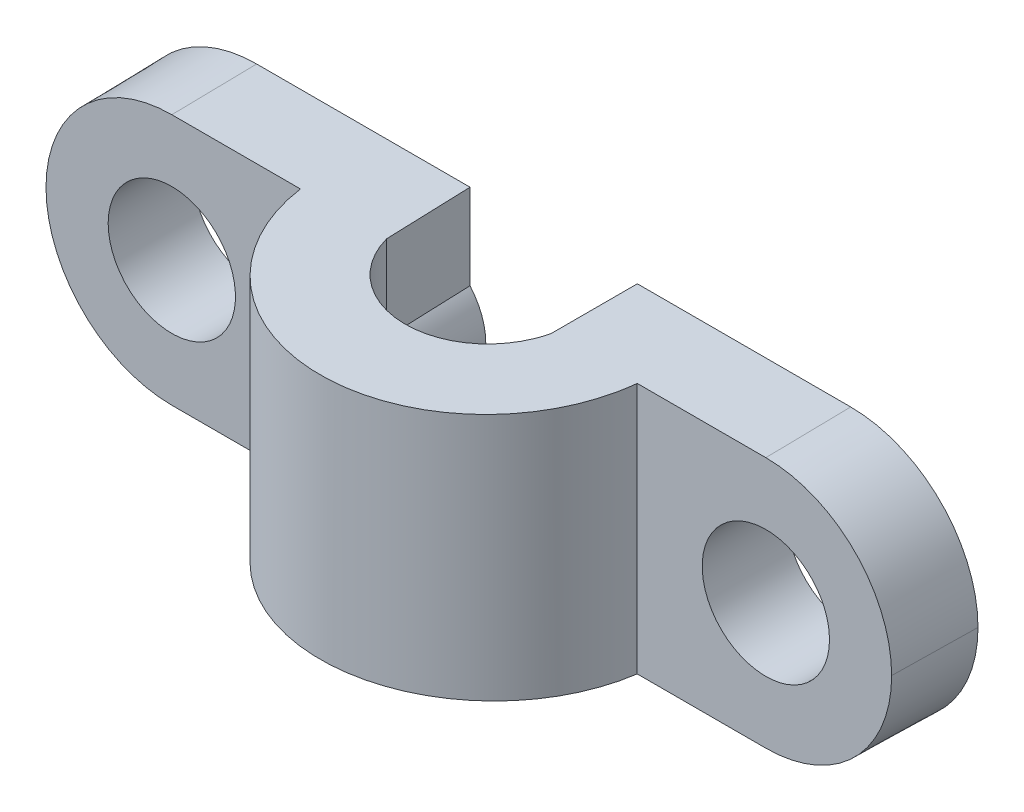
ISO-10303-21;
HEADER;
FILE_DESCRIPTION(('STEP AP214'),'2;1');
FILE_NAME('part.step','',(''),(''),'','','');
FILE_SCHEMA(('AUTOMOTIVE_DESIGN { 1 0 10303 214 1 1 1 1 }'));
ENDSEC;
DATA;
#1=APPLICATION_CONTEXT('core data for automotive mechanical design processes');
#2=APPLICATION_PROTOCOL_DEFINITION('international standard','automotive_design',2000,#1);
#3=PRODUCT_CONTEXT('',#1,'mechanical');
#4=PRODUCT('Part','Part','',(#3));
#5=PRODUCT_RELATED_PRODUCT_CATEGORY('part','',(#4));
#6=PRODUCT_DEFINITION_FORMATION('','',#4);
#7=PRODUCT_DEFINITION_CONTEXT('part definition',#1,'design');
#8=PRODUCT_DEFINITION('design','',#6,#7);
#9=PRODUCT_DEFINITION_SHAPE('','',#8);
#10=(LENGTH_UNIT() NAMED_UNIT(*) SI_UNIT(.MILLI.,.METRE.));
#11=(NAMED_UNIT(*) PLANE_ANGLE_UNIT() SI_UNIT($,.RADIAN.));
#12=(NAMED_UNIT(*) SI_UNIT($,.STERADIAN.) SOLID_ANGLE_UNIT());
#13=UNCERTAINTY_MEASURE_WITH_UNIT(LENGTH_MEASURE(1.E-05),#10,'distance_accuracy_value','');
#14=(GEOMETRIC_REPRESENTATION_CONTEXT(3) GLOBAL_UNCERTAINTY_ASSIGNED_CONTEXT((#13)) GLOBAL_UNIT_ASSIGNED_CONTEXT((#10,
#11,#12)) REPRESENTATION_CONTEXT('',''));
#15=CARTESIAN_POINT('',(0.,0.,0.));
#16=DIRECTION('',(0.,0.,1.));
#17=DIRECTION('',(1.,0.,0.));
#18=AXIS2_PLACEMENT_3D('',#15,#16,#17);
#19=CARTESIAN_POINT('',(-15.973571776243,-147.245065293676,1.99995));
#20=DIRECTION('',(-0.999847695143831,-5.01170538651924E-06,-0.0174524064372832));
#21=DIRECTION('',(-0.0174524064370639,-8.74796429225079E-08,0.999847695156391));
#22=AXIS2_PLACEMENT_3D('',#19,#20,#21);
#23=PLANE('',#22);
#24=DIRECTION('',(-5.01246880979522E-06,0.999999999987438,0.));
#25=VECTOR('',#24,1.);
#26=CARTESIAN_POINT('',(-15.9386625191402,-147.245065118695,0.));
#27=LINE('',#26,#25);
#28=CARTESIAN_POINT('',(-15.9386625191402,-147.245065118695,0.));
#29=VERTEX_POINT('',#28);
#30=CARTESIAN_POINT('',(-15.9386524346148,-149.256953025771,0.));
#31=VERTEX_POINT('',#30);
#32=EDGE_CURVE('E164',#29,#31,#27,.F.);
#33=ORIENTED_EDGE('',*,*,#32,.T.);
#34=CARTESIAN_POINT('',(-14.810077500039,-150.244984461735,-64.6557309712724));
#35=DIRECTION('',(-0.999847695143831,-5.01170538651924E-06,-0.0174524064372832));
#36=DIRECTION('',(-0.0174524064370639,-8.74796429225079E-08,0.999847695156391));
#37=AXIS2_PLACEMENT_3D('',#34,#35,#36);
#38=ELLIPSE('',#37,85.9458840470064,1.4999625);
#39=CARTESIAN_POINT('',(-15.9648342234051,-149.287683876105,1.4999625));
#40=VERTEX_POINT('',#39);
#41=EDGE_CURVE('E20',#31,#40,#38,.F.);
#42=ORIENTED_EDGE('',*,*,#41,.T.);
#43=CARTESIAN_POINT('',(-15.9735618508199,-149.22521188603,1.99994999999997));
#44=CARTESIAN_POINT('',(-15.9726841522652,-149.23789250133,1.9496703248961));
#45=CARTESIAN_POINT('',(-15.9717988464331,-149.24911449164,1.89895441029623));
#46=CARTESIAN_POINT('',(-15.9700230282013,-149.267666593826,1.797223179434));
#47=CARTESIAN_POINT('',(-15.9691326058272,-149.275025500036,1.74621302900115));
#48=CARTESIAN_POINT('',(-15.9673422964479,-149.285100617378,1.64364916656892));
#49=CARTESIAN_POINT('',(-15.9664424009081,-149.287812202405,1.59209496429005));
#50=CARTESIAN_POINT('',(-15.9650892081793,-149.288136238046,1.51457069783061));
#51=CARTESIAN_POINT('',(-15.9646358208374,-149.287610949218,1.4885960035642));
#52=CARTESIAN_POINT('',(-15.9637299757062,-149.285324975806,1.43669951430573));
#53=CARTESIAN_POINT('',(-15.9632775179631,-149.28356423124,1.4107777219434));
#54=CARTESIAN_POINT('',(-15.9628259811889,-149.281201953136,1.38490851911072));
#55=B_SPLINE_CURVE_WITH_KNOTS('',3,(#43,#44,#45,#46,#47,#48,#49,#50,#51,#52,#53,#54),
.UNSPECIFIED.,.F.,.F.,(4,2,2,2,2,4),(0.,0.15566218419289,0.310147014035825,0.464785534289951,
0.542711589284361,0.620641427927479),.UNSPECIFIED.);
#56=CARTESIAN_POINT('',(-15.9735618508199,-149.22521188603,1.99995));
#57=VERTEX_POINT('',#56);
#58=EDGE_CURVE('E205',#40,#57,#55,.F.);
#59=ORIENTED_EDGE('',*,*,#58,.T.);
#60=DIRECTION('',(5.01246880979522E-06,-0.999999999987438,0.));
#61=VECTOR('',#60,1.);
#62=CARTESIAN_POINT('',(-15.973571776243,-147.245065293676,1.99995));
#63=LINE('',#62,#61);
#64=CARTESIAN_POINT('',(-15.9735716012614,-147.279974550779,1.99995));
#65=VERTEX_POINT('',#64);
#66=EDGE_CURVE('E200',#65,#57,#63,.T.);
#67=ORIENTED_EDGE('',*,*,#66,.F.);
#68=DIRECTION('',(0.0174496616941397,0.0174498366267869,-0.999695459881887));
#69=VECTOR('',#68,1.);
#70=CARTESIAN_POINT('',(-15.9735609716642,-147.279963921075,1.99934102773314));
#71=LINE('',#70,#69);
#72=EDGE_CURVE('E174',#29,#65,#71,.F.);
#73=ORIENTED_EDGE('',*,*,#72,.F.);
#74=EDGE_LOOP('',(#33,#42,#59,#67,#73));
#75=FACE_BOUND('',#74,.T.);
#76=ADVANCED_FACE('F16',(#75),#23,.T.);
#77=CARTESIAN_POINT('',(-19.846458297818,-147.245084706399,1.99995));
#78=DIRECTION('',(0.999847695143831,5.01170538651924E-06,-0.017452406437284));
#79=DIRECTION('',(-0.0174524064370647,-8.74796429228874E-08,-0.999847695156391));
#80=AXIS2_PLACEMENT_3D('',#77,#78,#79);
#81=PLANE('',#80);
#82=DIRECTION('',(-5.01246880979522E-06,0.999999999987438,0.));
#83=VECTOR('',#82,1.);
#84=CARTESIAN_POINT('',(-19.8813675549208,-147.245084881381,0.));
#85=LINE('',#84,#83);
#86=CARTESIAN_POINT('',(-19.8813475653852,-151.233046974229,0.));
#87=VERTEX_POINT('',#86);
#88=CARTESIAN_POINT('',(-19.8813374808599,-153.244934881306,0.));
#89=VERTEX_POINT('',#88);
#90=EDGE_CURVE('E801',#87,#89,#85,.F.);
#91=ORIENTED_EDGE('',*,*,#90,.F.);
#92=CARTESIAN_POINT('',(-21.0099224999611,-150.245015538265,-64.6557309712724));
#93=DIRECTION('',(0.999847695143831,5.01170538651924E-06,-0.017452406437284));
#94=DIRECTION('',(0.0174524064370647,8.74796429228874E-08,0.999847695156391));
#95=AXIS2_PLACEMENT_3D('',#92,#93,#94);
#96=ELLIPSE('',#95,85.9458840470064,1.4999625);
#97=CARTESIAN_POINT('',(-19.8551657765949,-151.202316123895,1.4999625));
#98=VERTEX_POINT('',#97);
#99=EDGE_CURVE('E249',#87,#98,#96,.F.);
#100=ORIENTED_EDGE('',*,*,#99,.T.);
#101=CARTESIAN_POINT('',(-19.8464381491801,-151.264788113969,1.99995));
#102=CARTESIAN_POINT('',(-19.8473158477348,-151.25210749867,1.9496703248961));
#103=CARTESIAN_POINT('',(-19.8482011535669,-151.24088550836,1.89895441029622));
#104=CARTESIAN_POINT('',(-19.8499769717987,-151.222333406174,1.79722317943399));
#105=CARTESIAN_POINT('',(-19.8508673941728,-151.214974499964,1.74621302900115));
#106=CARTESIAN_POINT('',(-19.8526577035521,-151.204899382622,1.64364916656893));
#107=CARTESIAN_POINT('',(-19.8535575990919,-151.202187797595,1.59209496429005));
#108=CARTESIAN_POINT('',(-19.8549107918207,-151.201863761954,1.5145706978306));
#109=CARTESIAN_POINT('',(-19.8553641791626,-151.202389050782,1.48859600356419));
#110=CARTESIAN_POINT('',(-19.8562700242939,-151.204675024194,1.43669951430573));
#111=CARTESIAN_POINT('',(-19.8567224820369,-151.20643576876,1.4107777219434));
#112=CARTESIAN_POINT('',(-19.8571740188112,-151.208798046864,1.38490851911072));
#113=B_SPLINE_CURVE_WITH_KNOTS('',3,(#101,#102,#103,#104,#105,#106,#107,#108,#109,#110,#111,
#112),.UNSPECIFIED.,.F.,.F.,(4,2,2,2,2,4),(0.,0.155662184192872,0.310147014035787,
0.46478553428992,0.542711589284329,0.620641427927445),.UNSPECIFIED.);
#114=CARTESIAN_POINT('',(-19.8464381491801,-151.264788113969,1.99995));
#115=VERTEX_POINT('',#114);
#116=EDGE_CURVE('E203',#98,#115,#113,.F.);
#117=ORIENTED_EDGE('',*,*,#116,.T.);
#118=DIRECTION('',(5.01246880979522E-06,-0.999999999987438,0.));
#119=VECTOR('',#118,1.);
#120=CARTESIAN_POINT('',(-19.846458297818,-147.245084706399,1.99995));
#121=LINE('',#120,#119);
#122=CARTESIAN_POINT('',(-19.8464283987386,-153.210025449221,1.99995));
#123=VERTEX_POINT('',#122);
#124=EDGE_CURVE('E247',#115,#123,#121,.T.);
#125=ORIENTED_EDGE('',*,*,#124,.T.);
#126=DIRECTION('',(-0.0174496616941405,-0.0174498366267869,-0.999695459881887));
#127=VECTOR('',#126,1.);
#128=CARTESIAN_POINT('',(-19.8446121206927,-153.208209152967,2.10400502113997));
#129=LINE('',#128,#127);
#130=EDGE_CURVE('E991',#123,#89,#129,.T.);
#131=ORIENTED_EDGE('',*,*,#130,.T.);
#132=EDGE_LOOP('',(#91,#100,#117,#125,#131));
#133=FACE_BOUND('',#132,.T.);
#134=ADVANCED_FACE('F250',(#133),#81,.T.);
#135=CARTESIAN_POINT('',(-17.9100150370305,-147.245075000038,1.4999625));
#136=DIRECTION('',(5.01246880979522E-06,-0.999999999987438,0.));
#137=DIRECTION('',(0.999999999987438,5.01246880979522E-06,0.));
#138=AXIS2_PLACEMENT_3D('',#135,#136,#137);
#139=CYLINDRICAL_SURFACE('',#138,1.99995);
#140=ORIENTED_EDGE('',*,*,#124,.F.);
#141=CARTESIAN_POINT('',(-17.9099948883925,-151.264778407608,1.4999625));
#142=DIRECTION('',(-5.01246880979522E-06,0.999999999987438,0.));
#143=DIRECTION('',(-0.999999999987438,-5.01246880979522E-06,0.));
#144=AXIS2_PLACEMENT_3D('',#141,#142,#143);
#145=CIRCLE('',#144,1.99995);
#146=CARTESIAN_POINT('',(-15.973551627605,-151.264768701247,1.99995));
#147=VERTEX_POINT('',#146);
#148=EDGE_CURVE('E675',#115,#147,#145,.T.);
#149=ORIENTED_EDGE('',*,*,#148,.T.);
#150=DIRECTION('',(5.01246880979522E-06,-0.999999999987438,0.));
#151=VECTOR('',#150,1.);
#152=CARTESIAN_POINT('',(-15.973571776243,-147.245065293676,1.99995));
#153=LINE('',#152,#151);
#154=CARTESIAN_POINT('',(-15.9735418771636,-153.210006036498,1.99995));
#155=VERTEX_POINT('',#154);
#156=EDGE_CURVE('E204',#147,#155,#153,.T.);
#157=ORIENTED_EDGE('',*,*,#156,.T.);
#158=CARTESIAN_POINT('',(-17.9099850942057,-153.218743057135,1.4999625));
#159=DIRECTION('',(5.01170538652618E-06,-0.999847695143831,0.0174524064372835));
#160=DIRECTION('',(8.74796424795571E-08,-0.0174524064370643,-0.999847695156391));
#161=AXIS2_PLACEMENT_3D('',#158,#159,#160);
#162=ELLIPSE('',#161,2.00025464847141,1.99995);
#163=EDGE_CURVE('E1005',#155,#123,#162,.T.);
#164=ORIENTED_EDGE('',*,*,#163,.T.);
#165=EDGE_LOOP('',(#140,#149,#157,#164));
#166=FACE_BOUND('',#165,.T.);
#167=ADVANCED_FACE('F219',(#166),#139,.F.);
#168=ORIENTED_EDGE('',*,*,#66,.T.);
#169=CARTESIAN_POINT('',(-17.9100051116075,-149.225221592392,1.4999625));
#170=DIRECTION('',(5.01246880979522E-06,-0.999999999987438,0.));
#171=DIRECTION('',(0.999999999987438,5.01246880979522E-06,0.));
#172=AXIS2_PLACEMENT_3D('',#169,#170,#171);
#173=CIRCLE('',#172,1.99995);
#174=CARTESIAN_POINT('',(-19.846448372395,-149.225231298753,1.99995));
#175=VERTEX_POINT('',#174);
#176=EDGE_CURVE('E663',#57,#175,#173,.T.);
#177=ORIENTED_EDGE('',*,*,#176,.T.);
#178=DIRECTION('',(5.01246880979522E-06,-0.999999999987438,0.));
#179=VECTOR('',#178,1.);
#180=CARTESIAN_POINT('',(-19.846458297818,-147.245084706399,1.99995));
#181=LINE('',#180,#179);
#182=CARTESIAN_POINT('',(-19.8464581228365,-147.279993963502,1.99995));
#183=VERTEX_POINT('',#182);
#184=EDGE_CURVE('E770',#183,#175,#181,.T.);
#185=ORIENTED_EDGE('',*,*,#184,.F.);
#186=CARTESIAN_POINT('',(-17.9100149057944,-147.271256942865,1.4999625));
#187=DIRECTION('',(-5.0117053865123E-06,0.999847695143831,0.0174524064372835));
#188=DIRECTION('',(8.74796433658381E-08,-0.0174524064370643,0.999847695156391));
#189=AXIS2_PLACEMENT_3D('',#186,#187,#188);
#190=ELLIPSE('',#189,2.00025464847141,1.99995);
#191=EDGE_CURVE('E198',#65,#183,#190,.F.);
#192=ORIENTED_EDGE('',*,*,#191,.F.);
#193=EDGE_LOOP('',(#168,#177,#185,#192));
#194=FACE_BOUND('',#193,.T.);
#195=ADVANCED_FACE('F270',(#194),#139,.F.);
#196=CARTESIAN_POINT('',(-15.973571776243,-147.245065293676,1.99995));
#197=DIRECTION('',(-0.999847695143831,-5.01170538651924E-06,-0.0174524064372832));
#198=DIRECTION('',(-0.0174524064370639,-8.74796429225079E-08,0.999847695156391));
#199=AXIS2_PLACEMENT_3D('',#196,#197,#198);
#200=PLANE('',#199);
#201=CARTESIAN_POINT('',(-15.9863360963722,-151.504021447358,2.73244042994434));
#202=CARTESIAN_POINT('',(-15.9855881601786,-151.4894685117,2.68958701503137));
#203=CARTESIAN_POINT('',(-15.9848419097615,-151.47464032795,2.64683009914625));
#204=CARTESIAN_POINT('',(-15.9833505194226,-151.444784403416,2.5613798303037));
#205=CARTESIAN_POINT('',(-15.982605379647,-151.42975663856,2.51868648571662));
#206=CARTESIAN_POINT('',(-15.9811050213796,-151.399673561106,2.43272237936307));
#207=CARTESIAN_POINT('',(-15.9803497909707,-151.384620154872,2.38945093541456));
#208=CARTESIAN_POINT('',(-15.9788357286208,-151.355127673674,2.3027018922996));
#209=CARTESIAN_POINT('',(-15.9780768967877,-151.340688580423,2.2592242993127));
#210=CARTESIAN_POINT('',(-15.975865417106,-151.300411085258,2.13251714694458));
#211=CARTESIAN_POINT('',(-15.9744042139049,-151.276035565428,2.04879787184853));
#212=CARTESIAN_POINT('',(-15.9714517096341,-151.236049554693,1.87963753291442));
#213=CARTESIAN_POINT('',(-15.969960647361,-151.220386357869,1.79421013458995));
#214=CARTESIAN_POINT('',(-15.9673564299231,-151.20457685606,1.64501007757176));
#215=CARTESIAN_POINT('',(-15.9662491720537,-151.201395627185,1.58157440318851));
#216=CARTESIAN_POINT('',(-15.96403248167,-151.202638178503,1.45458065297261));
#217=CARTESIAN_POINT('',(-15.9629230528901,-151.207085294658,1.39102279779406));
#218=CARTESIAN_POINT('',(-15.9606857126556,-151.223004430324,1.26285023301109));
#219=CARTESIAN_POINT('',(-15.9595583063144,-151.234691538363,1.19826452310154));
#220=CARTESIAN_POINT('',(-15.9573279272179,-151.263220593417,1.07049438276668));
#221=CARTESIAN_POINT('',(-15.9562248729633,-151.280041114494,1.00730527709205));
#222=CARTESIAN_POINT('',(-15.9551330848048,-151.298461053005,0.944762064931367));
#223=B_SPLINE_CURVE_WITH_KNOTS('',3,(#201,#202,#203,#204,#205,#206,#207,#208,#209,#210,#211,
#212,#213,#214,#215,#216,#217,#218,#219,#220,#221,#222),.UNSPECIFIED.,.F.,.F.,(4,2,2,2,2,2,2,2,
2,2,4),(0.,0.135784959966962,0.271586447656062,0.409047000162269,0.546503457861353,
0.807920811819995,1.06773900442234,1.25787517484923,1.44859403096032,1.64527011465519,
1.84113628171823),.UNSPECIFIED.);
#224=CARTESIAN_POINT('',(-15.9648246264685,-151.202296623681,1.4999625));
#225=VERTEX_POINT('',#224);
#226=EDGE_CURVE('E210',#147,#225,#223,.T.);
#227=ORIENTED_EDGE('',*,*,#226,.T.);
#228=CARTESIAN_POINT('',(-14.810077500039,-150.244984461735,-64.6557309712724));
#229=DIRECTION('',(-0.999847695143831,-5.01170538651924E-06,-0.0174524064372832));
#230=DIRECTION('',(-0.0174524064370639,-8.74796429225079E-08,0.999847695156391));
#231=AXIS2_PLACEMENT_3D('',#228,#229,#230);
#232=ELLIPSE('',#231,85.9458840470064,1.4999625);
#233=CARTESIAN_POINT('',(-15.9386425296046,-151.233027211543,0.));
#234=VERTEX_POINT('',#233);
#235=EDGE_CURVE('E150',#225,#234,#232,.F.);
#236=ORIENTED_EDGE('',*,*,#235,.T.);
#237=DIRECTION('',(-5.01246880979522E-06,0.999999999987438,0.));
#238=VECTOR('',#237,1.);
#239=CARTESIAN_POINT('',(-15.9386625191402,-147.245065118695,0.));
#240=LINE('',#239,#238);
#241=CARTESIAN_POINT('',(-15.9386324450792,-153.244915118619,0.));
#242=VERTEX_POINT('',#241);
#243=EDGE_CURVE('E168',#234,#242,#240,.F.);
#244=ORIENTED_EDGE('',*,*,#243,.T.);
#245=DIRECTION('',(-0.0174498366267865,0.0174496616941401,0.999695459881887));
#246=VECTOR('',#245,1.);
#247=CARTESIAN_POINT('',(-15.9753581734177,-153.208189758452,2.10400502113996));
#248=LINE('',#247,#246);
#249=EDGE_CURVE('E1016',#242,#155,#248,.T.);
#250=ORIENTED_EDGE('',*,*,#249,.T.);
#251=ORIENTED_EDGE('',*,*,#156,.F.);
#252=EDGE_LOOP('',(#227,#236,#244,#250,#251));
#253=FACE_BOUND('',#252,.T.);
#254=ADVANCED_FACE('F254',(#253),#200,.T.);
#255=CARTESIAN_POINT('',(-19.846458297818,-147.245084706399,1.99995));
#256=DIRECTION('',(0.999847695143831,5.01170538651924E-06,-0.017452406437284));
#257=DIRECTION('',(-0.0174524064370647,-8.74796429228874E-08,-0.999847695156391));
#258=AXIS2_PLACEMENT_3D('',#255,#256,#257);
#259=PLANE('',#258);
#260=CARTESIAN_POINT('',(-19.8318989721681,-148.952226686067,2.83356297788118));
#261=CARTESIAN_POINT('',(-19.8326917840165,-148.967070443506,2.78813855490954));
#262=CARTESIAN_POINT('',(-19.8334820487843,-148.982342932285,2.74285993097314));
#263=CARTESIAN_POINT('',(-19.8350596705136,-149.013370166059,2.65246913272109));
#264=CARTESIAN_POINT('',(-19.8358470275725,-149.029124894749,2.60735695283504));
#265=CARTESIAN_POINT('',(-19.8374295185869,-149.060912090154,2.51668697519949));
#266=CARTESIAN_POINT('',(-19.8382246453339,-149.076945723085,2.47112959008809));
#267=CARTESIAN_POINT('',(-19.8398171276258,-149.108643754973,2.37988723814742));
#268=CARTESIAN_POINT('',(-19.840614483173,-149.124308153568,2.3342022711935));
#269=CARTESIAN_POINT('',(-19.8429439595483,-149.168607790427,2.20073393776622));
#270=CARTESIAN_POINT('',(-19.8444832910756,-149.196050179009,2.11253781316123));
#271=CARTESIAN_POINT('',(-19.8475956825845,-149.242418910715,1.93421570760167));
#272=CARTESIAN_POINT('',(-19.8491685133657,-149.261390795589,1.84410284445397));
#273=CARTESIAN_POINT('',(-19.8516789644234,-149.280349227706,1.70027375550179));
#274=CARTESIAN_POINT('',(-19.8526055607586,-149.284964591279,1.64718776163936));
#275=CARTESIAN_POINT('',(-19.8544637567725,-149.288920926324,1.54073064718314));
#276=CARTESIAN_POINT('',(-19.8553953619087,-149.28825388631,1.48735921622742));
#277=CARTESIAN_POINT('',(-19.8572723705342,-149.281642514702,1.37982736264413));
#278=CARTESIAN_POINT('',(-19.8582176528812,-149.275587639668,1.32567391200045));
#279=CARTESIAN_POINT('',(-19.8596253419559,-149.263064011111,1.24503105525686));
#280=CARTESIAN_POINT('',(-19.8600927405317,-149.258317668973,1.21825517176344));
#281=CARTESIAN_POINT('',(-19.8610238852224,-149.247825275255,1.16491294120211));
#282=CARTESIAN_POINT('',(-19.861487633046,-149.24207972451,1.13834649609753));
#283=CARTESIAN_POINT('',(-19.8619496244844,-149.235905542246,1.11188079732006));
#284=B_SPLINE_CURVE_WITH_KNOTS('',3,(#260,#261,#262,#263,#264,#265,#266,#267,#268,#269,#270,
#271,#272,#273,#274,#275,#276,#277,#278,#279,#280,#281,#282,#283),.UNSPECIFIED.,.F.,.F.,(4,2,2,
2,2,2,2,2,2,2,2,4),(0.,0.143374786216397,0.286744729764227,0.431653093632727,0.576561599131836,
0.853566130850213,1.12906286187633,1.28870455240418,1.44858840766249,1.61183026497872,
1.69340695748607,1.77494287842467),.UNSPECIFIED.);
#285=CARTESIAN_POINT('',(-19.8551753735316,-149.287703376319,1.4999625));
#286=VERTEX_POINT('',#285);
#287=EDGE_CURVE('E226',#175,#286,#284,.T.);
#288=ORIENTED_EDGE('',*,*,#287,.T.);
#289=CARTESIAN_POINT('',(-21.0099224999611,-150.245015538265,-64.6557309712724));
#290=DIRECTION('',(0.999847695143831,5.01170538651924E-06,-0.017452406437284));
#291=DIRECTION('',(0.0174524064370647,8.74796429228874E-08,0.999847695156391));
#292=AXIS2_PLACEMENT_3D('',#289,#290,#291);
#293=ELLIPSE('',#292,85.9458840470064,1.4999625);
#294=CARTESIAN_POINT('',(-19.8813574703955,-149.256972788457,0.));
#295=VERTEX_POINT('',#294);
#296=EDGE_CURVE('E194',#286,#295,#293,.F.);
#297=ORIENTED_EDGE('',*,*,#296,.T.);
#298=DIRECTION('',(-5.01246880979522E-06,0.999999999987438,0.));
#299=VECTOR('',#298,1.);
#300=CARTESIAN_POINT('',(-19.8813675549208,-147.245084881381,0.));
#301=LINE('',#300,#299);
#302=CARTESIAN_POINT('',(-19.8813675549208,-147.245084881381,0.));
#303=VERTEX_POINT('',#302);
#304=EDGE_CURVE('E790',#303,#295,#301,.F.);
#305=ORIENTED_EDGE('',*,*,#304,.F.);
#306=DIRECTION('',(0.0174498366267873,-0.0174496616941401,0.999695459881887));
#307=VECTOR('',#306,1.);
#308=CARTESIAN_POINT('',(-19.8464687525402,-147.279983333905,1.99934102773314));
#309=LINE('',#308,#307);
#310=EDGE_CURVE('E903',#183,#303,#309,.F.);
#311=ORIENTED_EDGE('',*,*,#310,.F.);
#312=ORIENTED_EDGE('',*,*,#184,.T.);
#313=EDGE_LOOP('',(#288,#297,#305,#311,#312));
#314=FACE_BOUND('',#313,.T.);
#315=ADVANCED_FACE('F257',(#314),#259,.T.);
#316=CARTESIAN_POINT('',(-19.846458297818,-147.245084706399,0.));
#317=DIRECTION('',(0.,0.,1.));
#318=DIRECTION('',(0.999999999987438,5.01246880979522E-06,0.));
#319=AXIS2_PLACEMENT_3D('',#316,#317,#318);
#320=PLANE('',#319);
#321=CARTESIAN_POINT('',(-24.9098249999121,-150.245035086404,0.));
#322=DIRECTION('',(0.,0.,1.));
#323=DIRECTION('',(-0.999999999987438,-5.01246880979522E-06,0.));
#324=AXIS2_PLACEMENT_3D('',#321,#322,#323);
#325=CIRCLE('',#324,1.4999625);
#326=CARTESIAN_POINT('',(-26.4097874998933,-150.24504260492,0.));
#327=VERTEX_POINT('',#326);
#328=EDGE_CURVE('E1104',#327,#327,#325,.T.);
#329=ORIENTED_EDGE('',*,*,#328,.T.);
#330=EDGE_LOOP('',(#329));
#331=FACE_BOUND('',#330,.T.);
#332=CARTESIAN_POINT('',(-24.9098249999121,-150.245035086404,0.));
#333=DIRECTION('',(0.,0.,1.));
#334=DIRECTION('',(0.999999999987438,5.01246880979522E-06,0.));
#335=AXIS2_PLACEMENT_3D('',#332,#333,#334);
#336=CIRCLE('',#335,2.999925);
#337=CARTESIAN_POINT('',(-24.9098099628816,-153.244960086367,0.));
#338=VERTEX_POINT('',#337);
#339=CARTESIAN_POINT('',(-27.9097499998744,-150.245050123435,0.));
#340=VERTEX_POINT('',#339);
#341=EDGE_CURVE('E27',#338,#340,#336,.F.);
#342=ORIENTED_EDGE('',*,*,#341,.T.);
#343=CARTESIAN_POINT('',(-24.9098249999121,-150.245035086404,0.));
#344=DIRECTION('',(0.,0.,1.));
#345=DIRECTION('',(0.999999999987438,5.01246880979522E-06,0.));
#346=AXIS2_PLACEMENT_3D('',#343,#344,#345);
#347=CIRCLE('',#346,2.999925);
#348=CARTESIAN_POINT('',(-24.9098400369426,-147.245110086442,0.));
#349=VERTEX_POINT('',#348);
#350=EDGE_CURVE('E11',#340,#349,#347,.F.);
#351=ORIENTED_EDGE('',*,*,#350,.T.);
#352=DIRECTION('',(-0.999999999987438,-5.01246880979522E-06,0.));
#353=VECTOR('',#352,1.);
#354=CARTESIAN_POINT('',(-19.846458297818,-147.245084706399,0.));
#355=LINE('',#354,#353);
#356=EDGE_CURVE('E890',#303,#349,#355,.T.);
#357=ORIENTED_EDGE('',*,*,#356,.F.);
#358=ORIENTED_EDGE('',*,*,#304,.T.);
#359=CARTESIAN_POINT('',(-21.0099224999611,-150.245015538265,0.));
#360=DIRECTION('',(0.,0.,1.));
#361=DIRECTION('',(0.999999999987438,5.01246880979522E-06,0.));
#362=AXIS2_PLACEMENT_3D('',#359,#360,#361);
#363=CIRCLE('',#362,1.4999625);
#364=EDGE_CURVE('E149',#87,#295,#363,.T.);
#365=ORIENTED_EDGE('',*,*,#364,.F.);
#366=ORIENTED_EDGE('',*,*,#90,.T.);
#367=DIRECTION('',(0.999999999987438,5.01246880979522E-06,0.));
#368=VECTOR('',#367,1.);
#369=CARTESIAN_POINT('',(-19.8464282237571,-153.244934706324,0.));
#370=LINE('',#369,#368);
#371=EDGE_CURVE('E980',#89,#338,#370,.F.);
#372=ORIENTED_EDGE('',*,*,#371,.T.);
#373=EDGE_LOOP('',(#342,#351,#357,#358,#365,#366,#372));
#374=FACE_BOUND('',#373,.T.);
#375=ADVANCED_FACE('F260',(#331,#374),#320,.F.);
#376=CARTESIAN_POINT('',(-21.8785427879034,-147.245094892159,1.99995));
#377=DIRECTION('',(0.,0.,-1.));
#378=DIRECTION('',(-0.999999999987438,-5.01246880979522E-06,0.));
#379=AXIS2_PLACEMENT_3D('',#376,#377,#378);
#380=PLANE('',#379);
#381=CARTESIAN_POINT('',(-24.9098249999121,-150.245035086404,1.99995));
#382=DIRECTION('',(0.,0.,1.));
#383=DIRECTION('',(-0.999999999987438,-5.01246880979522E-06,0.));
#384=AXIS2_PLACEMENT_3D('',#381,#382,#383);
#385=CIRCLE('',#384,1.4999625);
#386=CARTESIAN_POINT('',(-26.4097874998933,-150.24504260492,1.99995));
#387=VERTEX_POINT('',#386);
#388=EDGE_CURVE('E1115',#387,#387,#385,.T.);
#389=ORIENTED_EDGE('',*,*,#388,.F.);
#390=EDGE_LOOP('',(#389));
#391=FACE_BOUND('',#390,.T.);
#392=DIRECTION('',(0.999999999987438,5.01246880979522E-06,0.));
#393=VECTOR('',#392,1.);
#394=CARTESIAN_POINT('',(-21.8785426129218,-147.280004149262,1.99995));
#395=LINE('',#394,#393);
#396=CARTESIAN_POINT('',(-24.909839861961,-147.280019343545,1.99995));
#397=VERTEX_POINT('',#396);
#398=CARTESIAN_POINT('',(-21.8785426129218,-147.280004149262,1.99995));
#399=VERTEX_POINT('',#398);
#400=EDGE_CURVE('E878',#397,#399,#395,.T.);
#401=ORIENTED_EDGE('',*,*,#400,.F.);
#402=CARTESIAN_POINT('',(-24.9098249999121,-150.245035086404,1.99995));
#403=DIRECTION('',(0.,0.,-1.));
#404=DIRECTION('',(-0.999999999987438,-5.01246880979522E-06,0.));
#405=AXIS2_PLACEMENT_3D('',#402,#403,#404);
#406=CIRCLE('',#405,2.96501574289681);
#407=CARTESIAN_POINT('',(-27.8748407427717,-150.245049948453,1.99995));
#408=VERTEX_POINT('',#407);
#409=EDGE_CURVE('E544',#397,#408,#406,.F.);
#410=ORIENTED_EDGE('',*,*,#409,.T.);
#411=CARTESIAN_POINT('',(-24.9098249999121,-150.245035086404,1.99995));
#412=DIRECTION('',(0.,0.,-1.));
#413=DIRECTION('',(-0.999999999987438,-5.01246880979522E-06,0.));
#414=AXIS2_PLACEMENT_3D('',#411,#412,#413);
#415=CIRCLE('',#414,2.96501574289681);
#416=CARTESIAN_POINT('',(-24.9098101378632,-153.210050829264,1.99995));
#417=VERTEX_POINT('',#416);
#418=EDGE_CURVE('E555',#408,#417,#415,.F.);
#419=ORIENTED_EDGE('',*,*,#418,.T.);
#420=DIRECTION('',(-0.999999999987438,-5.01246880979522E-06,0.));
#421=VECTOR('',#420,1.);
#422=CARTESIAN_POINT('',(-21.878512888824,-153.210035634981,1.99995));
#423=LINE('',#422,#421);
#424=CARTESIAN_POINT('',(-21.878512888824,-153.210035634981,1.99995));
#425=VERTEX_POINT('',#424);
#426=EDGE_CURVE('E969',#417,#425,#423,.F.);
#427=ORIENTED_EDGE('',*,*,#426,.T.);
#428=DIRECTION('',(5.01246880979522E-06,-0.999999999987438,0.));
#429=VECTOR('',#428,1.);
#430=CARTESIAN_POINT('',(-21.8785427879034,-147.245094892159,1.99995));
#431=LINE('',#430,#429);
#432=EDGE_CURVE('E187',#399,#425,#431,.T.);
#433=ORIENTED_EDGE('',*,*,#432,.F.);
#434=EDGE_LOOP('',(#401,#410,#419,#427,#433));
#435=FACE_BOUND('',#434,.T.);
#436=ADVANCED_FACE('F268',(#391,#435),#380,.F.);
#437=CARTESIAN_POINT('',(-17.9100150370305,-147.245075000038,1.4999625));
#438=DIRECTION('',(5.01246880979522E-06,-0.999999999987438,0.));
#439=DIRECTION('',(0.999999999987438,5.01246880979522E-06,0.));
#440=AXIS2_PLACEMENT_3D('',#437,#438,#439);
#441=CYLINDRICAL_SURFACE('',#440,3.9999);
#442=CARTESIAN_POINT('',(-17.9099850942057,-153.218743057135,1.4999625));
#443=DIRECTION('',(5.01170538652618E-06,-0.999847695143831,0.0174524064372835));
#444=DIRECTION('',(8.74796424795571E-08,-0.0174524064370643,-0.999847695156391));
#445=AXIS2_PLACEMENT_3D('',#442,#443,#444);
#446=ELLIPSE('',#445,4.00050929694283,3.9999);
#447=CARTESIAN_POINT('',(-13.9414573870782,-153.209995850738,1.99995));
#448=VERTEX_POINT('',#447);
#449=EDGE_CURVE('E957',#425,#448,#446,.F.);
#450=ORIENTED_EDGE('',*,*,#449,.T.);
#451=DIRECTION('',(5.01246880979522E-06,-0.999999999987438,0.));
#452=VECTOR('',#451,1.);
#453=CARTESIAN_POINT('',(-13.9414872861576,-147.245055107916,1.99995));
#454=LINE('',#453,#452);
#455=CARTESIAN_POINT('',(-13.9414871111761,-147.279964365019,1.99995));
#456=VERTEX_POINT('',#455);
#457=EDGE_CURVE('E176',#456,#448,#454,.T.);
#458=ORIENTED_EDGE('',*,*,#457,.F.);
#459=CARTESIAN_POINT('',(-17.9100149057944,-147.271256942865,1.4999625));
#460=DIRECTION('',(-5.0117053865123E-06,0.999847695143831,0.0174524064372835));
#461=DIRECTION('',(8.74796433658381E-08,-0.0174524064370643,0.999847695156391));
#462=AXIS2_PLACEMENT_3D('',#459,#460,#461);
#463=ELLIPSE('',#462,4.00050929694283,3.9999);
#464=EDGE_CURVE('E866',#399,#456,#463,.T.);
#465=ORIENTED_EDGE('',*,*,#464,.F.);
#466=ORIENTED_EDGE('',*,*,#432,.T.);
#467=EDGE_LOOP('',(#450,#458,#465,#466));
#468=FACE_BOUND('',#467,.T.);
#469=ADVANCED_FACE('F326',(#468),#441,.T.);
#470=CARTESIAN_POINT('',(-7.91026503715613,-147.245024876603,1.99995));
#471=DIRECTION('',(0.,0.,-1.));
#472=DIRECTION('',(-0.999999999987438,-5.01246880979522E-06,0.));
#473=AXIS2_PLACEMENT_3D('',#470,#471,#472);
#474=PLANE('',#473);
#475=CARTESIAN_POINT('',(-10.9101750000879,-150.244964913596,1.99995));
#476=DIRECTION('',(0.,0.,1.));
#477=DIRECTION('',(0.999999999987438,5.01246880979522E-06,0.));
#478=AXIS2_PLACEMENT_3D('',#475,#476,#477);
#479=CIRCLE('',#478,1.4999625);
#480=CARTESIAN_POINT('',(-9.41021250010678,-150.24495739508,1.99995));
#481=VERTEX_POINT('',#480);
#482=EDGE_CURVE('E1093',#481,#481,#479,.T.);
#483=ORIENTED_EDGE('',*,*,#482,.F.);
#484=EDGE_LOOP('',(#483));
#485=FACE_BOUND('',#484,.T.);
#486=DIRECTION('',(-0.999999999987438,-5.01246880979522E-06,0.));
#487=VECTOR('',#486,1.);
#488=CARTESIAN_POINT('',(-7.9102351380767,-153.209965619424,1.99995));
#489=LINE('',#488,#487);
#490=CARTESIAN_POINT('',(-10.910160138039,-153.209980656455,1.99995));
#491=VERTEX_POINT('',#490);
#492=EDGE_CURVE('E944',#448,#491,#489,.F.);
#493=ORIENTED_EDGE('',*,*,#492,.T.);
#494=CARTESIAN_POINT('',(-10.9101750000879,-150.244964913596,1.99995));
#495=DIRECTION('',(0.,0.,-1.));
#496=DIRECTION('',(-0.999999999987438,-5.01246880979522E-06,0.));
#497=AXIS2_PLACEMENT_3D('',#494,#495,#496);
#498=CIRCLE('',#497,2.96501574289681);
#499=CARTESIAN_POINT('',(-7.94515925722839,-150.244950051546,1.99995));
#500=VERTEX_POINT('',#499);
#501=EDGE_CURVE('E592',#491,#500,#498,.F.);
#502=ORIENTED_EDGE('',*,*,#501,.T.);
#503=CARTESIAN_POINT('',(-10.9101750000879,-150.244964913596,1.99995));
#504=DIRECTION('',(0.,0.,-1.));
#505=DIRECTION('',(-0.999999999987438,-5.01246880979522E-06,0.));
#506=AXIS2_PLACEMENT_3D('',#503,#504,#505);
#507=CIRCLE('',#506,2.96501574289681);
#508=CARTESIAN_POINT('',(-10.9101898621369,-147.279949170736,1.99995));
#509=VERTEX_POINT('',#508);
#510=EDGE_CURVE('E603',#500,#509,#507,.F.);
#511=ORIENTED_EDGE('',*,*,#510,.T.);
#512=DIRECTION('',(0.999999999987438,5.01246880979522E-06,0.));
#513=VECTOR('',#512,1.);
#514=CARTESIAN_POINT('',(-7.91026486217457,-147.279934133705,1.99995));
#515=LINE('',#514,#513);
#516=EDGE_CURVE('E854',#456,#509,#515,.T.);
#517=ORIENTED_EDGE('',*,*,#516,.F.);
#518=ORIENTED_EDGE('',*,*,#457,.T.);
#519=EDGE_LOOP('',(#493,#502,#511,#517,#518));
#520=FACE_BOUND('',#519,.T.);
#521=ADVANCED_FACE('F337',(#485,#520),#474,.F.);
#522=CARTESIAN_POINT('',(-7.91026503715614,-147.245024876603,0.));
#523=DIRECTION('',(0.,0.,1.));
#524=DIRECTION('',(0.999999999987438,5.01246880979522E-06,0.));
#525=AXIS2_PLACEMENT_3D('',#522,#523,#524);
#526=PLANE('',#525);
#527=CARTESIAN_POINT('',(-10.9101750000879,-150.244964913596,0.));
#528=DIRECTION('',(0.,0.,1.));
#529=DIRECTION('',(0.999999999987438,5.01246880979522E-06,0.));
#530=AXIS2_PLACEMENT_3D('',#527,#528,#529);
#531=CIRCLE('',#530,1.4999625);
#532=CARTESIAN_POINT('',(-9.41021250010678,-150.24495739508,0.));
#533=VERTEX_POINT('',#532);
#534=EDGE_CURVE('E169',#533,#533,#531,.T.);
#535=ORIENTED_EDGE('',*,*,#534,.T.);
#536=EDGE_LOOP('',(#535));
#537=FACE_BOUND('',#536,.T.);
#538=CARTESIAN_POINT('',(-10.9101750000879,-150.244964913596,0.));
#539=DIRECTION('',(0.,0.,1.));
#540=DIRECTION('',(0.999999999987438,5.01246880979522E-06,0.));
#541=AXIS2_PLACEMENT_3D('',#538,#539,#540);
#542=CIRCLE('',#541,2.999925);
#543=CARTESIAN_POINT('',(-10.9101900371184,-147.245039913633,0.));
#544=VERTEX_POINT('',#543);
#545=CARTESIAN_POINT('',(-7.91025000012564,-150.244949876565,0.));
#546=VERTEX_POINT('',#545);
#547=EDGE_CURVE('E651',#544,#546,#542,.F.);
#548=ORIENTED_EDGE('',*,*,#547,.T.);
#549=CARTESIAN_POINT('',(-10.9101750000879,-150.244964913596,0.));
#550=DIRECTION('',(0.,0.,1.));
#551=DIRECTION('',(0.999999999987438,5.01246880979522E-06,0.));
#552=AXIS2_PLACEMENT_3D('',#549,#550,#551);
#553=CIRCLE('',#552,2.999925);
#554=CARTESIAN_POINT('',(-10.9101599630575,-153.244889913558,0.));
#555=VERTEX_POINT('',#554);
#556=EDGE_CURVE('E639',#546,#555,#553,.F.);
#557=ORIENTED_EDGE('',*,*,#556,.T.);
#558=DIRECTION('',(0.999999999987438,5.01246880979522E-06,0.));
#559=VECTOR('',#558,1.);
#560=CARTESIAN_POINT('',(-7.91023496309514,-153.244874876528,0.));
#561=LINE('',#560,#559);
#562=EDGE_CURVE('E199',#555,#242,#561,.F.);
#563=ORIENTED_EDGE('',*,*,#562,.T.);
#564=ORIENTED_EDGE('',*,*,#243,.F.);
#565=CARTESIAN_POINT('',(-14.810077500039,-150.244984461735,0.));
#566=DIRECTION('',(0.,0.,1.));
#567=DIRECTION('',(-0.999999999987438,-5.01246880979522E-06,0.));
#568=AXIS2_PLACEMENT_3D('',#565,#566,#567);
#569=CIRCLE('',#568,1.4999625);
#570=EDGE_CURVE('E143',#31,#234,#569,.T.);
#571=ORIENTED_EDGE('',*,*,#570,.F.);
#572=ORIENTED_EDGE('',*,*,#32,.F.);
#573=DIRECTION('',(-0.999999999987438,-5.01246880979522E-06,0.));
#574=VECTOR('',#573,1.);
#575=CARTESIAN_POINT('',(-7.91026503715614,-147.245024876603,0.));
#576=LINE('',#575,#574);
#577=EDGE_CURVE('E190',#544,#29,#576,.T.);
#578=ORIENTED_EDGE('',*,*,#577,.F.);
#579=EDGE_LOOP('',(#548,#557,#563,#564,#571,#572,#578));
#580=FACE_BOUND('',#579,.T.);
#581=ADVANCED_FACE('F161',(#537,#580),#526,.F.);
#582=CARTESIAN_POINT('',(-19.846458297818,-147.245084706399,0.));
#583=DIRECTION('',(-5.0117053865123E-06,0.999847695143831,0.0174524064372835));
#584=DIRECTION('',(8.74796433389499E-08,-0.0174524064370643,0.999847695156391));
#585=AXIS2_PLACEMENT_3D('',#582,#583,#584);
#586=PLANE('',#585);
#587=ORIENTED_EDGE('',*,*,#516,.T.);
#588=DIRECTION('',(-8.74796433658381E-08,0.0174524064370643,-0.999847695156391));
#589=VECTOR('',#588,1.);
#590=CARTESIAN_POINT('',(-10.9101900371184,-147.245039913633,0.));
#591=LINE('',#590,#589);
#592=EDGE_CURVE('E567',#509,#544,#591,.T.);
#593=ORIENTED_EDGE('',*,*,#592,.T.);
#594=ORIENTED_EDGE('',*,*,#577,.T.);
#595=ORIENTED_EDGE('',*,*,#72,.T.);
#596=ORIENTED_EDGE('',*,*,#191,.T.);
#597=ORIENTED_EDGE('',*,*,#310,.T.);
#598=ORIENTED_EDGE('',*,*,#356,.T.);
#599=DIRECTION('',(-8.74796433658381E-08,0.0174524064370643,-0.999847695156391));
#600=VECTOR('',#599,1.);
#601=CARTESIAN_POINT('',(-24.9098400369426,-147.245110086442,0.));
#602=LINE('',#601,#600);
#603=EDGE_CURVE('E579',#349,#397,#602,.F.);
#604=ORIENTED_EDGE('',*,*,#603,.T.);
#605=ORIENTED_EDGE('',*,*,#400,.T.);
#606=ORIENTED_EDGE('',*,*,#464,.T.);
#607=EDGE_LOOP('',(#587,#593,#594,#595,#596,#597,#598,#604,#605,#606));
#608=FACE_BOUND('',#607,.T.);
#609=ADVANCED_FACE('F358',(#608),#586,.T.);
#610=CARTESIAN_POINT('',(-19.8464282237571,-153.244934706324,0.));
#611=DIRECTION('',(5.01170538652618E-06,-0.999847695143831,0.0174524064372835));
#612=DIRECTION('',(8.74796425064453E-08,-0.0174524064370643,-0.999847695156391));
#613=AXIS2_PLACEMENT_3D('',#610,#611,#612);
#614=PLANE('',#613);
#615=ORIENTED_EDGE('',*,*,#562,.F.);
#616=DIRECTION('',(8.74796424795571E-08,-0.0174524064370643,-0.999847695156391));
#617=VECTOR('',#616,1.);
#618=CARTESIAN_POINT('',(-10.9101599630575,-153.244889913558,0.));
#619=LINE('',#618,#617);
#620=EDGE_CURVE('E615',#555,#491,#619,.F.);
#621=ORIENTED_EDGE('',*,*,#620,.T.);
#622=ORIENTED_EDGE('',*,*,#492,.F.);
#623=ORIENTED_EDGE('',*,*,#449,.F.);
#624=ORIENTED_EDGE('',*,*,#426,.F.);
#625=DIRECTION('',(8.74796424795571E-08,-0.0174524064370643,-0.999847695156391));
#626=VECTOR('',#625,1.);
#627=CARTESIAN_POINT('',(-24.9098099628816,-153.244960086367,0.));
#628=LINE('',#627,#626);
#629=EDGE_CURVE('E627',#417,#338,#628,.T.);
#630=ORIENTED_EDGE('',*,*,#629,.T.);
#631=ORIENTED_EDGE('',*,*,#371,.F.);
#632=ORIENTED_EDGE('',*,*,#130,.F.);
#633=ORIENTED_EDGE('',*,*,#163,.F.);
#634=ORIENTED_EDGE('',*,*,#249,.F.);
#635=EDGE_LOOP('',(#615,#621,#622,#623,#624,#630,#631,#632,#633,#634));
#636=FACE_BOUND('',#635,.T.);
#637=ADVANCED_FACE('F217',(#636),#614,.T.);
#638=CARTESIAN_POINT('',(-17.91,-150.245,1.4999625));
#639=DIRECTION('',(5.01246880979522E-06,-0.999999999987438,0.));
#640=DIRECTION('',(0.999999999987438,5.01246880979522E-06,0.));
#641=AXIS2_PLACEMENT_3D('',#638,#639,#640);
#642=TOROIDAL_SURFACE('',#641,3.0999225,1.4999625);
#643=ORIENTED_EDGE('',*,*,#58,.F.);
#644=CARTESIAN_POINT('',(-14.810077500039,-150.244984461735,1.4999625));
#645=DIRECTION('',(0.,0.,1.));
#646=DIRECTION('',(0.999999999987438,5.01246880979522E-06,0.));
#647=AXIS2_PLACEMENT_3D('',#644,#645,#646);
#648=CIRCLE('',#647,1.4999625);
#649=EDGE_CURVE('E132',#40,#225,#648,.T.);
#650=ORIENTED_EDGE('',*,*,#649,.T.);
#651=ORIENTED_EDGE('',*,*,#226,.F.);
#652=ORIENTED_EDGE('',*,*,#148,.F.);
#653=ORIENTED_EDGE('',*,*,#116,.F.);
#654=CARTESIAN_POINT('',(-21.0099224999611,-150.245015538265,1.4999625));
#655=DIRECTION('',(0.,0.,1.));
#656=DIRECTION('',(0.999999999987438,5.01246880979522E-06,0.));
#657=AXIS2_PLACEMENT_3D('',#654,#655,#656);
#658=CIRCLE('',#657,1.4999625);
#659=EDGE_CURVE('E688',#98,#286,#658,.T.);
#660=ORIENTED_EDGE('',*,*,#659,.T.);
#661=ORIENTED_EDGE('',*,*,#287,.F.);
#662=ORIENTED_EDGE('',*,*,#176,.F.);
#663=EDGE_LOOP('',(#643,#650,#651,#652,#653,#660,#661,#662));
#664=FACE_BOUND('',#663,.T.);
#665=ADVANCED_FACE('F211',(#664),#642,.T.);
#666=CARTESIAN_POINT('',(-21.0099224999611,-150.245015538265,0.));
#667=DIRECTION('',(0.,0.,1.));
#668=DIRECTION('',(0.999999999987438,5.01246880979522E-06,0.));
#669=AXIS2_PLACEMENT_3D('',#666,#667,#668);
#670=CYLINDRICAL_SURFACE('',#669,1.4999625);
#671=ORIENTED_EDGE('',*,*,#99,.F.);
#672=ORIENTED_EDGE('',*,*,#364,.T.);
#673=ORIENTED_EDGE('',*,*,#296,.F.);
#674=ORIENTED_EDGE('',*,*,#659,.F.);
#675=EDGE_LOOP('',(#671,#672,#673,#674));
#676=FACE_BOUND('',#675,.T.);
#677=ADVANCED_FACE('F216',(#676),#670,.T.);
#678=CARTESIAN_POINT('',(-14.810077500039,-150.244984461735,0.));
#679=DIRECTION('',(0.,0.,1.));
#680=DIRECTION('',(0.999999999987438,5.01246880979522E-06,0.));
#681=AXIS2_PLACEMENT_3D('',#678,#679,#680);
#682=CYLINDRICAL_SURFACE('',#681,1.4999625);
#683=ORIENTED_EDGE('',*,*,#41,.F.);
#684=ORIENTED_EDGE('',*,*,#570,.T.);
#685=ORIENTED_EDGE('',*,*,#235,.F.);
#686=ORIENTED_EDGE('',*,*,#649,.F.);
#687=EDGE_LOOP('',(#683,#684,#685,#686));
#688=FACE_BOUND('',#687,.T.);
#689=ADVANCED_FACE('F142',(#688),#682,.T.);
#690=CARTESIAN_POINT('',(-10.9101750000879,-150.244964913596,0.));
#691=DIRECTION('',(0.,0.,1.));
#692=DIRECTION('',(0.999999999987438,5.01246880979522E-06,0.));
#693=AXIS2_PLACEMENT_3D('',#690,#691,#692);
#694=CYLINDRICAL_SURFACE('',#693,1.4999625);
#695=ORIENTED_EDGE('',*,*,#534,.F.);
#696=EDGE_LOOP('',(#695));
#697=FACE_BOUND('',#696,.T.);
#698=ORIENTED_EDGE('',*,*,#482,.T.);
#699=EDGE_LOOP('',(#698));
#700=FACE_BOUND('',#699,.T.);
#701=ADVANCED_FACE('F404',(#697,#700),#694,.F.);
#702=CARTESIAN_POINT('',(-24.9098249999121,-150.245035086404,0.));
#703=DIRECTION('',(0.,0.,1.));
#704=DIRECTION('',(0.999999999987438,5.01246880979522E-06,0.));
#705=AXIS2_PLACEMENT_3D('',#702,#703,#704);
#706=CYLINDRICAL_SURFACE('',#705,1.4999625);
#707=ORIENTED_EDGE('',*,*,#328,.F.);
#708=EDGE_LOOP('',(#707));
#709=FACE_BOUND('',#708,.T.);
#710=ORIENTED_EDGE('',*,*,#388,.T.);
#711=EDGE_LOOP('',(#710));
#712=FACE_BOUND('',#711,.T.);
#713=ADVANCED_FACE('F414',(#709,#712),#706,.F.);
#714=CARTESIAN_POINT('',(-10.9101750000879,-150.244964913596,0.));
#715=DIRECTION('',(0.,0.,-1.));
#716=DIRECTION('',(0.999999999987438,5.01246880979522E-06,0.));
#717=AXIS2_PLACEMENT_3D('',#714,#715,#716);
#718=CONICAL_SURFACE('',#717,2.999925,0.0174532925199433);
#719=ORIENTED_EDGE('',*,*,#592,.F.);
#720=ORIENTED_EDGE('',*,*,#510,.F.);
#721=DIRECTION('',(0.0174524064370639,8.74796429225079E-08,-0.999847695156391));
#722=VECTOR('',#721,1.);
#723=CARTESIAN_POINT('',(-7.91025000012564,-150.244949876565,0.));
#724=LINE('',#723,#722);
#725=EDGE_CURVE('E1126',#546,#500,#724,.F.);
#726=ORIENTED_EDGE('',*,*,#725,.F.);
#727=ORIENTED_EDGE('',*,*,#547,.F.);
#728=EDGE_LOOP('',(#719,#720,#726,#727));
#729=FACE_BOUND('',#728,.T.);
#730=ADVANCED_FACE('F425',(#729),#718,.T.);
#731=CARTESIAN_POINT('',(-10.9101750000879,-150.244964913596,0.));
#732=DIRECTION('',(0.,0.,-1.));
#733=DIRECTION('',(0.999999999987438,5.01246880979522E-06,0.));
#734=AXIS2_PLACEMENT_3D('',#731,#732,#733);
#735=CONICAL_SURFACE('',#734,2.999925,0.0174532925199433);
#736=ORIENTED_EDGE('',*,*,#501,.F.);
#737=ORIENTED_EDGE('',*,*,#620,.F.);
#738=ORIENTED_EDGE('',*,*,#556,.F.);
#739=ORIENTED_EDGE('',*,*,#725,.T.);
#740=EDGE_LOOP('',(#736,#737,#738,#739));
#741=FACE_BOUND('',#740,.T.);
#742=ADVANCED_FACE('F436',(#741),#735,.T.);
#743=CARTESIAN_POINT('',(-24.9098249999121,-150.245035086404,0.));
#744=DIRECTION('',(0.,0.,-1.));
#745=DIRECTION('',(0.999999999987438,5.01246880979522E-06,0.));
#746=AXIS2_PLACEMENT_3D('',#743,#744,#745);
#747=CONICAL_SURFACE('',#746,2.999925,0.0174532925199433);
#748=DIRECTION('',(-0.0174524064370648,-8.74796429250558E-08,-0.999847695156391));
#749=VECTOR('',#748,1.);
#750=CARTESIAN_POINT('',(-27.9097499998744,-150.245050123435,0.));
#751=LINE('',#750,#749);
#752=EDGE_CURVE('E1137',#340,#408,#751,.F.);
#753=ORIENTED_EDGE('',*,*,#752,.F.);
#754=ORIENTED_EDGE('',*,*,#341,.F.);
#755=ORIENTED_EDGE('',*,*,#629,.F.);
#756=ORIENTED_EDGE('',*,*,#418,.F.);
#757=EDGE_LOOP('',(#753,#754,#755,#756));
#758=FACE_BOUND('',#757,.T.);
#759=ADVANCED_FACE('F447',(#758),#747,.T.);
#760=CARTESIAN_POINT('',(-24.9098249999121,-150.245035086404,0.));
#761=DIRECTION('',(0.,0.,-1.));
#762=DIRECTION('',(0.999999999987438,5.01246880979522E-06,0.));
#763=AXIS2_PLACEMENT_3D('',#760,#761,#762);
#764=CONICAL_SURFACE('',#763,2.999925,0.0174532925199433);
#765=ORIENTED_EDGE('',*,*,#350,.F.);
#766=ORIENTED_EDGE('',*,*,#752,.T.);
#767=ORIENTED_EDGE('',*,*,#409,.F.);
#768=ORIENTED_EDGE('',*,*,#603,.F.);
#769=EDGE_LOOP('',(#765,#766,#767,#768));
#770=FACE_BOUND('',#769,.T.);
#771=ADVANCED_FACE('F221',(#770),#764,.T.);
#772=CLOSED_SHELL('',(#76,#134,#167,#195,#254,#315,#375,#436,#469,#521,#581,#609,#637,#665,#677,
#689,#701,#713,#730,#742,#759,#771));
#773=MANIFOLD_SOLID_BREP('B1',#772);
#774=ADVANCED_BREP_SHAPE_REPRESENTATION('',(#18,#773),#14);
#775=SHAPE_DEFINITION_REPRESENTATION(#9,#774);
ENDSEC;
END-ISO-10303-21;
